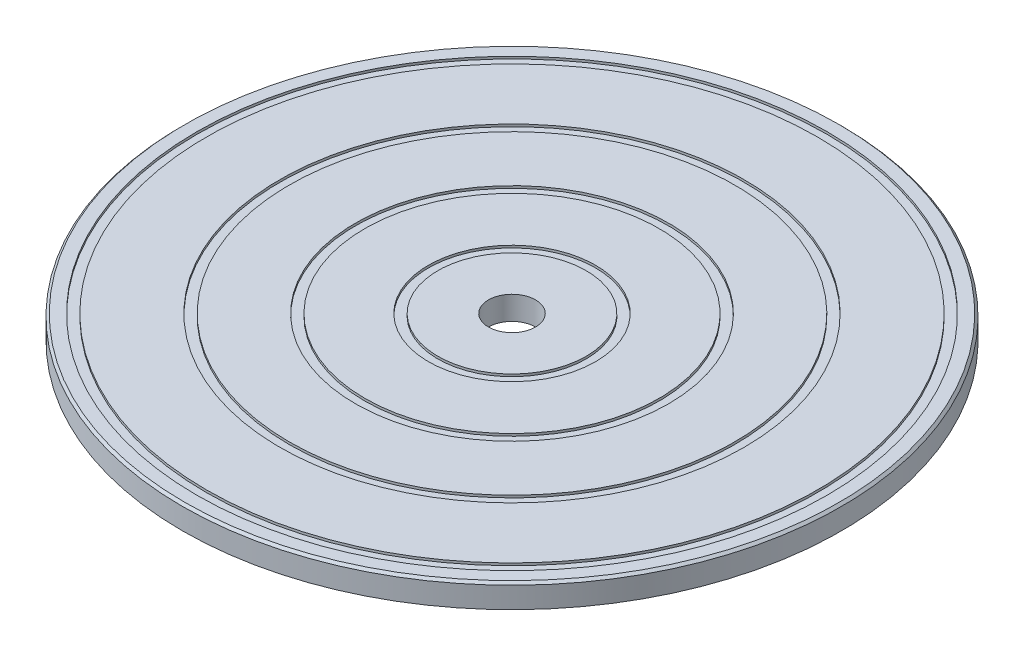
ISO-10303-21;
HEADER;
FILE_DESCRIPTION(('STEP AP214'),'2;1');
FILE_NAME('part.step','',(''),(''),'','','');
FILE_SCHEMA(('AUTOMOTIVE_DESIGN { 1 0 10303 214 1 1 1 1 }'));
ENDSEC;
DATA;
#1=APPLICATION_CONTEXT('core data for automotive mechanical design processes');
#2=APPLICATION_PROTOCOL_DEFINITION('international standard','automotive_design',2000,#1);
#3=PRODUCT_CONTEXT('',#1,'mechanical');
#4=PRODUCT('Part','Part','',(#3));
#5=PRODUCT_RELATED_PRODUCT_CATEGORY('part','',(#4));
#6=PRODUCT_DEFINITION_FORMATION('','',#4);
#7=PRODUCT_DEFINITION_CONTEXT('part definition',#1,'design');
#8=PRODUCT_DEFINITION('design','',#6,#7);
#9=PRODUCT_DEFINITION_SHAPE('','',#8);
#10=(LENGTH_UNIT() NAMED_UNIT(*) SI_UNIT(.MILLI.,.METRE.));
#11=(NAMED_UNIT(*) PLANE_ANGLE_UNIT() SI_UNIT($,.RADIAN.));
#12=(NAMED_UNIT(*) SI_UNIT($,.STERADIAN.) SOLID_ANGLE_UNIT());
#13=UNCERTAINTY_MEASURE_WITH_UNIT(LENGTH_MEASURE(1.E-05),#10,'distance_accuracy_value','');
#14=(GEOMETRIC_REPRESENTATION_CONTEXT(3) GLOBAL_UNCERTAINTY_ASSIGNED_CONTEXT((#13)) GLOBAL_UNIT_ASSIGNED_CONTEXT((#10,
#11,#12)) REPRESENTATION_CONTEXT('',''));
#15=CARTESIAN_POINT('',(0.,0.,0.));
#16=DIRECTION('',(0.,0.,1.));
#17=DIRECTION('',(1.,0.,0.));
#18=AXIS2_PLACEMENT_3D('',#15,#16,#17);
#19=CARTESIAN_POINT('',(0.,5.,0.));
#20=DIRECTION('',(0.,1.,0.));
#21=DIRECTION('',(0.,0.,1.));
#22=AXIS2_PLACEMENT_3D('',#19,#20,#21);
#23=PLANE('',#22);
#24=CARTESIAN_POINT('',(0.,5.,0.));
#25=DIRECTION('',(0.,1.,0.));
#26=DIRECTION('',(1.,0.,0.));
#27=AXIS2_PLACEMENT_3D('',#24,#25,#26);
#28=CIRCLE('',#27,49.2862684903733);
#29=CARTESIAN_POINT('',(49.2862684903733,5.,0.));
#30=VERTEX_POINT('',#29);
#31=EDGE_CURVE('E103',#30,#30,#28,.T.);
#32=ORIENTED_EDGE('',*,*,#31,.F.);
#33=EDGE_LOOP('',(#32));
#34=FACE_BOUND('',#33,.T.);
#35=CARTESIAN_POINT('',(0.,5.,0.));
#36=DIRECTION('',(0.,1.,0.));
#37=DIRECTION('',(0.,0.,1.));
#38=AXIS2_PLACEMENT_3D('',#35,#36,#37);
#39=CIRCLE('',#38,64.9115315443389);
#40=CARTESIAN_POINT('',(0.,5.,64.9115315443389));
#41=VERTEX_POINT('',#40);
#42=EDGE_CURVE('E121',#41,#41,#39,.T.);
#43=ORIENTED_EDGE('',*,*,#42,.T.);
#44=EDGE_LOOP('',(#43));
#45=FACE_BOUND('',#44,.T.);
#46=ADVANCED_FACE('F55',(#34,#45),#23,.T.);
#47=CARTESIAN_POINT('',(0.,5.,0.));
#48=DIRECTION('',(0.,1.,0.));
#49=DIRECTION('',(1.,0.,0.));
#50=AXIS2_PLACEMENT_3D('',#47,#48,#49);
#51=CIRCLE('',#50,33.2548401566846);
#52=CARTESIAN_POINT('',(33.2548401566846,5.,0.));
#53=VERTEX_POINT('',#52);
#54=EDGE_CURVE('E91',#53,#53,#51,.T.);
#55=ORIENTED_EDGE('',*,*,#54,.F.);
#56=EDGE_LOOP('',(#55));
#57=FACE_BOUND('',#56,.T.);
#58=CARTESIAN_POINT('',(0.,5.,0.));
#59=DIRECTION('',(0.,1.,0.));
#60=DIRECTION('',(0.,0.,1.));
#61=AXIS2_PLACEMENT_3D('',#58,#59,#60);
#62=CIRCLE('',#61,47.2862684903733);
#63=CARTESIAN_POINT('',(0.,5.,47.2862684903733));
#64=VERTEX_POINT('',#63);
#65=EDGE_CURVE('E109',#64,#64,#62,.T.);
#66=ORIENTED_EDGE('',*,*,#65,.T.);
#67=EDGE_LOOP('',(#66));
#68=FACE_BOUND('',#67,.T.);
#69=ADVANCED_FACE('F159',(#57,#68),#23,.T.);
#70=CARTESIAN_POINT('',(0.,5.,0.));
#71=DIRECTION('',(0.,1.,0.));
#72=DIRECTION('',(1.,0.,0.));
#73=AXIS2_PLACEMENT_3D('',#70,#71,#72);
#74=CIRCLE('',#73,17.7569165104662);
#75=CARTESIAN_POINT('',(17.7569165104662,5.,0.));
#76=VERTEX_POINT('',#75);
#77=EDGE_CURVE('E79',#76,#76,#74,.T.);
#78=ORIENTED_EDGE('',*,*,#77,.F.);
#79=EDGE_LOOP('',(#78));
#80=FACE_BOUND('',#79,.T.);
#81=CARTESIAN_POINT('',(0.,5.,0.));
#82=DIRECTION('',(0.,1.,0.));
#83=DIRECTION('',(0.,0.,1.));
#84=AXIS2_PLACEMENT_3D('',#81,#82,#83);
#85=CIRCLE('',#84,31.2548401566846);
#86=CARTESIAN_POINT('',(0.,5.,31.2548401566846));
#87=VERTEX_POINT('',#86);
#88=EDGE_CURVE('E97',#87,#87,#85,.T.);
#89=ORIENTED_EDGE('',*,*,#88,.T.);
#90=EDGE_LOOP('',(#89));
#91=FACE_BOUND('',#90,.T.);
#92=ADVANCED_FACE('F155',(#80,#91),#23,.T.);
#93=CARTESIAN_POINT('',(0.,5.,0.));
#94=DIRECTION('',(0.,1.,0.));
#95=DIRECTION('',(0.,0.,1.));
#96=AXIS2_PLACEMENT_3D('',#93,#94,#95);
#97=CIRCLE('',#96,5.);
#98=CARTESIAN_POINT('',(0.,5.,5.));
#99=VERTEX_POINT('',#98);
#100=EDGE_CURVE('E70',#99,#99,#97,.T.);
#101=ORIENTED_EDGE('',*,*,#100,.F.);
#102=EDGE_LOOP('',(#101));
#103=FACE_BOUND('',#102,.T.);
#104=CARTESIAN_POINT('',(0.,5.,0.));
#105=DIRECTION('',(0.,1.,0.));
#106=DIRECTION('',(1.,0.,0.));
#107=AXIS2_PLACEMENT_3D('',#104,#105,#106);
#108=CIRCLE('',#107,15.7569165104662);
#109=CARTESIAN_POINT('',(15.7569165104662,5.,0.));
#110=VERTEX_POINT('',#109);
#111=EDGE_CURVE('E85',#110,#110,#108,.T.);
#112=ORIENTED_EDGE('',*,*,#111,.T.);
#113=EDGE_LOOP('',(#112));
#114=FACE_BOUND('',#113,.T.);
#115=ADVANCED_FACE('F146',(#103,#114),#23,.T.);
#116=CARTESIAN_POINT('',(0.,5.,0.));
#117=DIRECTION('',(0.,1.,0.));
#118=DIRECTION('',(0.,0.,1.));
#119=AXIS2_PLACEMENT_3D('',#116,#117,#118);
#120=CIRCLE('',#119,69.5);
#121=CARTESIAN_POINT('',(0.,5.,69.5));
#122=VERTEX_POINT('',#121);
#123=EDGE_CURVE('E62',#122,#122,#120,.T.);
#124=ORIENTED_EDGE('',*,*,#123,.T.);
#125=EDGE_LOOP('',(#124));
#126=FACE_BOUND('',#125,.T.);
#127=CARTESIAN_POINT('',(0.,5.,0.));
#128=DIRECTION('',(0.,1.,0.));
#129=DIRECTION('',(1.,0.,0.));
#130=AXIS2_PLACEMENT_3D('',#127,#128,#129);
#131=CIRCLE('',#130,66.9115315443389);
#132=CARTESIAN_POINT('',(66.9115315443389,5.,0.));
#133=VERTEX_POINT('',#132);
#134=EDGE_CURVE('E115',#133,#133,#131,.T.);
#135=ORIENTED_EDGE('',*,*,#134,.F.);
#136=EDGE_LOOP('',(#135));
#137=FACE_BOUND('',#136,.T.);
#138=ADVANCED_FACE('F143',(#126,#137),#23,.T.);
#139=CARTESIAN_POINT('',(0.,0.,0.));
#140=DIRECTION('',(0.,1.,0.));
#141=DIRECTION('',(0.,0.,1.));
#142=AXIS2_PLACEMENT_3D('',#139,#140,#141);
#143=PLANE('',#142);
#144=CARTESIAN_POINT('',(0.,0.,0.));
#145=DIRECTION('',(0.,1.,0.));
#146=DIRECTION('',(0.,0.,1.));
#147=AXIS2_PLACEMENT_3D('',#144,#145,#146);
#148=CIRCLE('',#147,70.);
#149=CARTESIAN_POINT('',(0.,0.,70.));
#150=VERTEX_POINT('',#149);
#151=EDGE_CURVE('E66',#150,#150,#148,.T.);
#152=ORIENTED_EDGE('',*,*,#151,.F.);
#153=EDGE_LOOP('',(#152));
#154=FACE_BOUND('',#153,.T.);
#155=CARTESIAN_POINT('',(0.,0.,0.));
#156=DIRECTION('',(0.,1.,0.));
#157=DIRECTION('',(0.,0.,1.));
#158=AXIS2_PLACEMENT_3D('',#155,#156,#157);
#159=CIRCLE('',#158,5.);
#160=CARTESIAN_POINT('',(0.,0.,5.));
#161=VERTEX_POINT('',#160);
#162=EDGE_CURVE('E73',#161,#161,#159,.T.);
#163=ORIENTED_EDGE('',*,*,#162,.T.);
#164=EDGE_LOOP('',(#163));
#165=FACE_BOUND('',#164,.T.);
#166=ADVANCED_FACE('F145',(#154,#165),#143,.F.);
#167=CARTESIAN_POINT('',(0.,5.,0.));
#168=DIRECTION('',(0.,-1.,0.));
#169=DIRECTION('',(0.,0.,-1.));
#170=AXIS2_PLACEMENT_3D('',#167,#168,#169);
#171=CYLINDRICAL_SURFACE('',#170,70.);
#172=CARTESIAN_POINT('',(0.,4.50000000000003,0.));
#173=DIRECTION('',(0.,1.,0.));
#174=DIRECTION('',(0.,0.,1.));
#175=AXIS2_PLACEMENT_3D('',#172,#173,#174);
#176=CIRCLE('',#175,70.);
#177=CARTESIAN_POINT('',(0.,4.50000000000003,70.));
#178=VERTEX_POINT('',#177);
#179=EDGE_CURVE('E11',#178,#178,#176,.F.);
#180=ORIENTED_EDGE('',*,*,#179,.T.);
#181=EDGE_LOOP('',(#180));
#182=FACE_BOUND('',#181,.T.);
#183=ORIENTED_EDGE('',*,*,#151,.T.);
#184=EDGE_LOOP('',(#183));
#185=FACE_BOUND('',#184,.T.);
#186=ADVANCED_FACE('F152',(#182,#185),#171,.T.);
#187=CARTESIAN_POINT('',(0.,5.,0.));
#188=DIRECTION('',(0.,-1.,0.));
#189=DIRECTION('',(0.,0.,-1.));
#190=AXIS2_PLACEMENT_3D('',#187,#188,#189);
#191=CYLINDRICAL_SURFACE('',#190,5.);
#192=ORIENTED_EDGE('',*,*,#100,.T.);
#193=EDGE_LOOP('',(#192));
#194=FACE_BOUND('',#193,.T.);
#195=ORIENTED_EDGE('',*,*,#162,.F.);
#196=EDGE_LOOP('',(#195));
#197=FACE_BOUND('',#196,.T.);
#198=ADVANCED_FACE('F208',(#194,#197),#191,.F.);
#199=CARTESIAN_POINT('',(0.,4.5,0.));
#200=DIRECTION('',(0.,1.,0.));
#201=DIRECTION('',(0.,0.,1.));
#202=AXIS2_PLACEMENT_3D('',#199,#200,#201);
#203=CYLINDRICAL_SURFACE('',#202,17.7569165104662);
#204=CARTESIAN_POINT('',(0.,4.5,0.));
#205=DIRECTION('',(0.,1.,0.));
#206=DIRECTION('',(1.,0.,0.));
#207=AXIS2_PLACEMENT_3D('',#204,#205,#206);
#208=CIRCLE('',#207,17.7569165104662);
#209=CARTESIAN_POINT('',(17.7569165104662,4.5,0.));
#210=VERTEX_POINT('',#209);
#211=EDGE_CURVE('E76',#210,#210,#208,.T.);
#212=ORIENTED_EDGE('',*,*,#211,.F.);
#213=EDGE_LOOP('',(#212));
#214=FACE_BOUND('',#213,.T.);
#215=ORIENTED_EDGE('',*,*,#77,.T.);
#216=EDGE_LOOP('',(#215));
#217=FACE_BOUND('',#216,.T.);
#218=ADVANCED_FACE('F205',(#214,#217),#203,.F.);
#219=CARTESIAN_POINT('',(0.,4.5,0.));
#220=DIRECTION('',(0.,1.,0.));
#221=DIRECTION('',(0.,0.,1.));
#222=AXIS2_PLACEMENT_3D('',#219,#220,#221);
#223=PLANE('',#222);
#224=CARTESIAN_POINT('',(0.,4.5,0.));
#225=DIRECTION('',(0.,1.,0.));
#226=DIRECTION('',(1.,0.,0.));
#227=AXIS2_PLACEMENT_3D('',#224,#225,#226);
#228=CIRCLE('',#227,15.7569165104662);
#229=CARTESIAN_POINT('',(15.7569165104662,4.5,0.));
#230=VERTEX_POINT('',#229);
#231=EDGE_CURVE('E82',#230,#230,#228,.T.);
#232=ORIENTED_EDGE('',*,*,#231,.F.);
#233=EDGE_LOOP('',(#232));
#234=FACE_BOUND('',#233,.T.);
#235=ORIENTED_EDGE('',*,*,#211,.T.);
#236=EDGE_LOOP('',(#235));
#237=FACE_BOUND('',#236,.T.);
#238=ADVANCED_FACE('F201',(#234,#237),#223,.T.);
#239=CARTESIAN_POINT('',(0.,4.5,0.));
#240=DIRECTION('',(0.,1.,0.));
#241=DIRECTION('',(0.,0.,1.));
#242=AXIS2_PLACEMENT_3D('',#239,#240,#241);
#243=CYLINDRICAL_SURFACE('',#242,15.7569165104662);
#244=ORIENTED_EDGE('',*,*,#231,.T.);
#245=EDGE_LOOP('',(#244));
#246=FACE_BOUND('',#245,.T.);
#247=ORIENTED_EDGE('',*,*,#111,.F.);
#248=EDGE_LOOP('',(#247));
#249=FACE_BOUND('',#248,.T.);
#250=ADVANCED_FACE('F197',(#246,#249),#243,.T.);
#251=CARTESIAN_POINT('',(0.,4.5,0.));
#252=DIRECTION('',(0.,1.,0.));
#253=DIRECTION('',(0.,0.,1.));
#254=AXIS2_PLACEMENT_3D('',#251,#252,#253);
#255=CYLINDRICAL_SURFACE('',#254,33.2548401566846);
#256=CARTESIAN_POINT('',(0.,4.5,0.));
#257=DIRECTION('',(0.,1.,0.));
#258=DIRECTION('',(1.,0.,0.));
#259=AXIS2_PLACEMENT_3D('',#256,#257,#258);
#260=CIRCLE('',#259,33.2548401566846);
#261=CARTESIAN_POINT('',(33.2548401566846,4.5,0.));
#262=VERTEX_POINT('',#261);
#263=EDGE_CURVE('E88',#262,#262,#260,.T.);
#264=ORIENTED_EDGE('',*,*,#263,.F.);
#265=EDGE_LOOP('',(#264));
#266=FACE_BOUND('',#265,.T.);
#267=ORIENTED_EDGE('',*,*,#54,.T.);
#268=EDGE_LOOP('',(#267));
#269=FACE_BOUND('',#268,.T.);
#270=ADVANCED_FACE('F193',(#266,#269),#255,.F.);
#271=CARTESIAN_POINT('',(0.,4.5,0.));
#272=DIRECTION('',(0.,1.,0.));
#273=DIRECTION('',(0.,0.,1.));
#274=AXIS2_PLACEMENT_3D('',#271,#272,#273);
#275=PLANE('',#274);
#276=CARTESIAN_POINT('',(0.,4.5,0.));
#277=DIRECTION('',(0.,1.,0.));
#278=DIRECTION('',(0.,0.,1.));
#279=AXIS2_PLACEMENT_3D('',#276,#277,#278);
#280=CIRCLE('',#279,31.2548401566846);
#281=CARTESIAN_POINT('',(0.,4.5,31.2548401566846));
#282=VERTEX_POINT('',#281);
#283=EDGE_CURVE('E94',#282,#282,#280,.T.);
#284=ORIENTED_EDGE('',*,*,#283,.F.);
#285=EDGE_LOOP('',(#284));
#286=FACE_BOUND('',#285,.T.);
#287=ORIENTED_EDGE('',*,*,#263,.T.);
#288=EDGE_LOOP('',(#287));
#289=FACE_BOUND('',#288,.T.);
#290=ADVANCED_FACE('F189',(#286,#289),#275,.T.);
#291=CARTESIAN_POINT('',(0.,4.5,0.));
#292=DIRECTION('',(0.,1.,0.));
#293=DIRECTION('',(0.,0.,1.));
#294=AXIS2_PLACEMENT_3D('',#291,#292,#293);
#295=CYLINDRICAL_SURFACE('',#294,31.2548401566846);
#296=ORIENTED_EDGE('',*,*,#283,.T.);
#297=EDGE_LOOP('',(#296));
#298=FACE_BOUND('',#297,.T.);
#299=ORIENTED_EDGE('',*,*,#88,.F.);
#300=EDGE_LOOP('',(#299));
#301=FACE_BOUND('',#300,.T.);
#302=ADVANCED_FACE('F185',(#298,#301),#295,.T.);
#303=CARTESIAN_POINT('',(0.,4.5,0.));
#304=DIRECTION('',(0.,1.,0.));
#305=DIRECTION('',(0.,0.,1.));
#306=AXIS2_PLACEMENT_3D('',#303,#304,#305);
#307=CYLINDRICAL_SURFACE('',#306,49.2862684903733);
#308=CARTESIAN_POINT('',(0.,4.5,0.));
#309=DIRECTION('',(0.,1.,0.));
#310=DIRECTION('',(1.,0.,0.));
#311=AXIS2_PLACEMENT_3D('',#308,#309,#310);
#312=CIRCLE('',#311,49.2862684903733);
#313=CARTESIAN_POINT('',(49.2862684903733,4.5,0.));
#314=VERTEX_POINT('',#313);
#315=EDGE_CURVE('E100',#314,#314,#312,.T.);
#316=ORIENTED_EDGE('',*,*,#315,.F.);
#317=EDGE_LOOP('',(#316));
#318=FACE_BOUND('',#317,.T.);
#319=ORIENTED_EDGE('',*,*,#31,.T.);
#320=EDGE_LOOP('',(#319));
#321=FACE_BOUND('',#320,.T.);
#322=ADVANCED_FACE('F181',(#318,#321),#307,.F.);
#323=CARTESIAN_POINT('',(0.,4.5,0.));
#324=DIRECTION('',(0.,1.,0.));
#325=DIRECTION('',(0.,0.,1.));
#326=AXIS2_PLACEMENT_3D('',#323,#324,#325);
#327=PLANE('',#326);
#328=CARTESIAN_POINT('',(0.,4.5,0.));
#329=DIRECTION('',(0.,1.,0.));
#330=DIRECTION('',(0.,0.,1.));
#331=AXIS2_PLACEMENT_3D('',#328,#329,#330);
#332=CIRCLE('',#331,47.2862684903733);
#333=CARTESIAN_POINT('',(0.,4.5,47.2862684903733));
#334=VERTEX_POINT('',#333);
#335=EDGE_CURVE('E106',#334,#334,#332,.T.);
#336=ORIENTED_EDGE('',*,*,#335,.F.);
#337=EDGE_LOOP('',(#336));
#338=FACE_BOUND('',#337,.T.);
#339=ORIENTED_EDGE('',*,*,#315,.T.);
#340=EDGE_LOOP('',(#339));
#341=FACE_BOUND('',#340,.T.);
#342=ADVANCED_FACE('F177',(#338,#341),#327,.T.);
#343=CARTESIAN_POINT('',(0.,4.5,0.));
#344=DIRECTION('',(0.,1.,0.));
#345=DIRECTION('',(0.,0.,1.));
#346=AXIS2_PLACEMENT_3D('',#343,#344,#345);
#347=CYLINDRICAL_SURFACE('',#346,47.2862684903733);
#348=ORIENTED_EDGE('',*,*,#335,.T.);
#349=EDGE_LOOP('',(#348));
#350=FACE_BOUND('',#349,.T.);
#351=ORIENTED_EDGE('',*,*,#65,.F.);
#352=EDGE_LOOP('',(#351));
#353=FACE_BOUND('',#352,.T.);
#354=ADVANCED_FACE('F139',(#350,#353),#347,.T.);
#355=CARTESIAN_POINT('',(0.,4.5,0.));
#356=DIRECTION('',(0.,1.,0.));
#357=DIRECTION('',(0.,0.,1.));
#358=AXIS2_PLACEMENT_3D('',#355,#356,#357);
#359=CYLINDRICAL_SURFACE('',#358,66.9115315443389);
#360=CARTESIAN_POINT('',(0.,4.5,0.));
#361=DIRECTION('',(0.,1.,0.));
#362=DIRECTION('',(1.,0.,0.));
#363=AXIS2_PLACEMENT_3D('',#360,#361,#362);
#364=CIRCLE('',#363,66.9115315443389);
#365=CARTESIAN_POINT('',(66.9115315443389,4.5,0.));
#366=VERTEX_POINT('',#365);
#367=EDGE_CURVE('E112',#366,#366,#364,.T.);
#368=ORIENTED_EDGE('',*,*,#367,.F.);
#369=EDGE_LOOP('',(#368));
#370=FACE_BOUND('',#369,.T.);
#371=ORIENTED_EDGE('',*,*,#134,.T.);
#372=EDGE_LOOP('',(#371));
#373=FACE_BOUND('',#372,.T.);
#374=ADVANCED_FACE('F133',(#370,#373),#359,.F.);
#375=CARTESIAN_POINT('',(0.,4.5,0.));
#376=DIRECTION('',(0.,1.,0.));
#377=DIRECTION('',(0.,0.,1.));
#378=AXIS2_PLACEMENT_3D('',#375,#376,#377);
#379=PLANE('',#378);
#380=CARTESIAN_POINT('',(0.,4.5,0.));
#381=DIRECTION('',(0.,1.,0.));
#382=DIRECTION('',(0.,0.,1.));
#383=AXIS2_PLACEMENT_3D('',#380,#381,#382);
#384=CIRCLE('',#383,64.9115315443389);
#385=CARTESIAN_POINT('',(0.,4.5,64.9115315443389));
#386=VERTEX_POINT('',#385);
#387=EDGE_CURVE('E118',#386,#386,#384,.T.);
#388=ORIENTED_EDGE('',*,*,#387,.F.);
#389=EDGE_LOOP('',(#388));
#390=FACE_BOUND('',#389,.T.);
#391=ORIENTED_EDGE('',*,*,#367,.T.);
#392=EDGE_LOOP('',(#391));
#393=FACE_BOUND('',#392,.T.);
#394=ADVANCED_FACE('F130',(#390,#393),#379,.T.);
#395=CARTESIAN_POINT('',(0.,4.5,0.));
#396=DIRECTION('',(0.,1.,0.));
#397=DIRECTION('',(0.,0.,1.));
#398=AXIS2_PLACEMENT_3D('',#395,#396,#397);
#399=CYLINDRICAL_SURFACE('',#398,64.9115315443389);
#400=ORIENTED_EDGE('',*,*,#387,.T.);
#401=EDGE_LOOP('',(#400));
#402=FACE_BOUND('',#401,.T.);
#403=ORIENTED_EDGE('',*,*,#42,.F.);
#404=EDGE_LOOP('',(#403));
#405=FACE_BOUND('',#404,.T.);
#406=ADVANCED_FACE('F127',(#402,#405),#399,.T.);
#407=CARTESIAN_POINT('',(0.,5.,0.));
#408=DIRECTION('',(0.,-1.,0.));
#409=DIRECTION('',(0.,0.,-1.));
#410=AXIS2_PLACEMENT_3D('',#407,#408,#409);
#411=CONICAL_SURFACE('',#410,69.5,0.785398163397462);
#412=ORIENTED_EDGE('',*,*,#179,.F.);
#413=EDGE_LOOP('',(#412));
#414=FACE_BOUND('',#413,.T.);
#415=ORIENTED_EDGE('',*,*,#123,.F.);
#416=EDGE_LOOP('',(#415));
#417=FACE_BOUND('',#416,.T.);
#418=ADVANCED_FACE('F57',(#414,#417),#411,.T.);
#419=CLOSED_SHELL('',(#46,#69,#92,#115,#138,#166,#186,#198,#218,#238,#250,#270,#290,#302,#322,
#342,#354,#374,#394,#406,#418));
#420=MANIFOLD_SOLID_BREP('B2',#419);
#421=ADVANCED_BREP_SHAPE_REPRESENTATION('',(#18,#420),#14);
#422=SHAPE_DEFINITION_REPRESENTATION(#9,#421);
ENDSEC;
END-ISO-10303-21;
